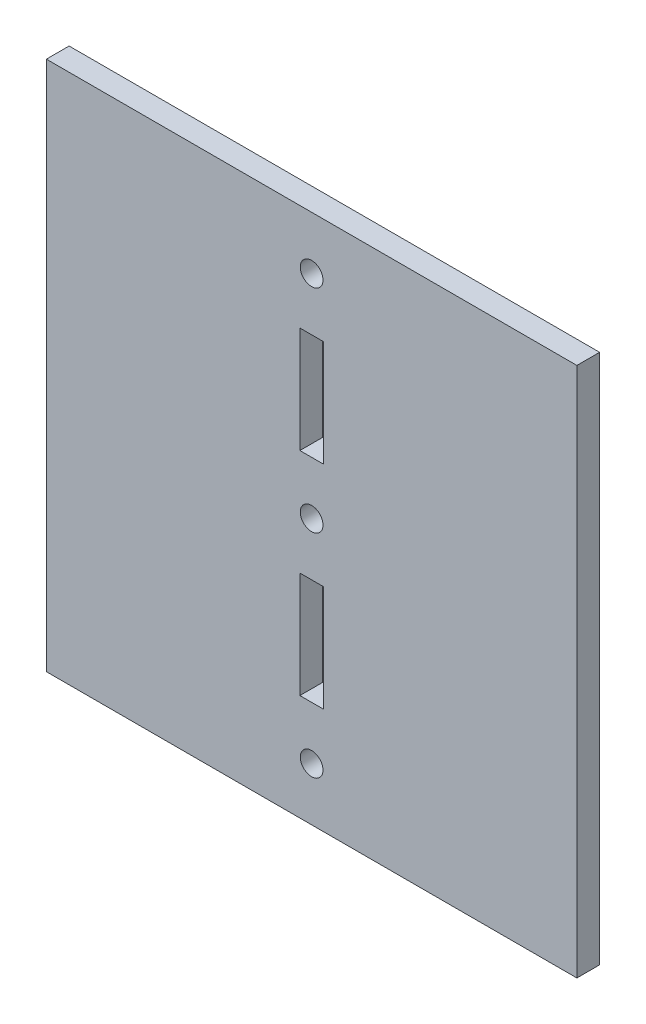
ISO-10303-21;
HEADER;
FILE_DESCRIPTION(('STEP AP214'),'2;1');
FILE_NAME('part.step','',(''),(''),'','','');
FILE_SCHEMA(('AUTOMOTIVE_DESIGN { 1 0 10303 214 1 1 1 1 }'));
ENDSEC;
DATA;
#1=APPLICATION_CONTEXT('core data for automotive mechanical design processes');
#2=APPLICATION_PROTOCOL_DEFINITION('international standard','automotive_design',2000,#1);
#3=PRODUCT_CONTEXT('',#1,'mechanical');
#4=PRODUCT('Part','Part','',(#3));
#5=PRODUCT_RELATED_PRODUCT_CATEGORY('part','',(#4));
#6=PRODUCT_DEFINITION_FORMATION('','',#4);
#7=PRODUCT_DEFINITION_CONTEXT('part definition',#1,'design');
#8=PRODUCT_DEFINITION('design','',#6,#7);
#9=PRODUCT_DEFINITION_SHAPE('','',#8);
#10=(LENGTH_UNIT() NAMED_UNIT(*) SI_UNIT(.MILLI.,.METRE.));
#11=(NAMED_UNIT(*) PLANE_ANGLE_UNIT() SI_UNIT($,.RADIAN.));
#12=(NAMED_UNIT(*) SI_UNIT($,.STERADIAN.) SOLID_ANGLE_UNIT());
#13=UNCERTAINTY_MEASURE_WITH_UNIT(LENGTH_MEASURE(1.E-05),#10,'distance_accuracy_value','');
#14=(GEOMETRIC_REPRESENTATION_CONTEXT(3) GLOBAL_UNCERTAINTY_ASSIGNED_CONTEXT((#13)) GLOBAL_UNIT_ASSIGNED_CONTEXT((#10,
#11,#12)) REPRESENTATION_CONTEXT('',''));
#15=CARTESIAN_POINT('',(0.,0.,0.));
#16=DIRECTION('',(0.,0.,1.));
#17=DIRECTION('',(1.,0.,0.));
#18=AXIS2_PLACEMENT_3D('',#15,#16,#17);
#19=CARTESIAN_POINT('',(0.,0.,3.));
#20=DIRECTION('',(0.,0.,-1.));
#21=DIRECTION('',(-1.,0.,0.));
#22=AXIS2_PLACEMENT_3D('',#19,#20,#21);
#23=PLANE('',#22);
#24=DIRECTION('',(0.,1.,0.));
#25=VECTOR('',#24,1.);
#26=CARTESIAN_POINT('',(1.55,7.,3.));
#27=LINE('',#26,#25);
#28=CARTESIAN_POINT('',(1.55,7.,3.));
#29=VERTEX_POINT('',#28);
#30=CARTESIAN_POINT('',(1.55,21.,3.));
#31=VERTEX_POINT('',#30);
#32=EDGE_CURVE('E162',#29,#31,#27,.T.);
#33=ORIENTED_EDGE('',*,*,#32,.F.);
#34=DIRECTION('',(1.,0.,0.));
#35=VECTOR('',#34,1.);
#36=CARTESIAN_POINT('',(-1.55,7.,3.));
#37=LINE('',#36,#35);
#38=CARTESIAN_POINT('',(-1.55,7.,3.));
#39=VERTEX_POINT('',#38);
#40=EDGE_CURVE('E170',#39,#29,#37,.T.);
#41=ORIENTED_EDGE('',*,*,#40,.F.);
#42=DIRECTION('',(0.,-1.,0.));
#43=VECTOR('',#42,1.);
#44=CARTESIAN_POINT('',(-1.55,7.,3.));
#45=LINE('',#44,#43);
#46=CARTESIAN_POINT('',(-1.55,21.,3.));
#47=VERTEX_POINT('',#46);
#48=EDGE_CURVE('E167',#47,#39,#45,.T.);
#49=ORIENTED_EDGE('',*,*,#48,.F.);
#50=DIRECTION('',(-1.,0.,0.));
#51=VECTOR('',#50,1.);
#52=CARTESIAN_POINT('',(-1.55,21.,3.));
#53=LINE('',#52,#51);
#54=EDGE_CURVE('E164',#31,#47,#53,.T.);
#55=ORIENTED_EDGE('',*,*,#54,.F.);
#56=EDGE_LOOP('',(#33,#41,#49,#55));
#57=FACE_BOUND('',#56,.T.);
#58=DIRECTION('',(0.,1.,0.));
#59=VECTOR('',#58,1.);
#60=CARTESIAN_POINT('',(35.,-35.,3.));
#61=LINE('',#60,#59);
#62=CARTESIAN_POINT('',(35.,-35.,3.));
#63=VERTEX_POINT('',#62);
#64=CARTESIAN_POINT('',(35.,35.,3.));
#65=VERTEX_POINT('',#64);
#66=EDGE_CURVE('E193',#63,#65,#61,.T.);
#67=ORIENTED_EDGE('',*,*,#66,.T.);
#68=DIRECTION('',(-1.,0.,0.));
#69=VECTOR('',#68,1.);
#70=CARTESIAN_POINT('',(-35.,35.,3.));
#71=LINE('',#70,#69);
#72=CARTESIAN_POINT('',(-35.,35.,3.));
#73=VERTEX_POINT('',#72);
#74=EDGE_CURVE('E196',#65,#73,#71,.T.);
#75=ORIENTED_EDGE('',*,*,#74,.T.);
#76=DIRECTION('',(0.,-1.,0.));
#77=VECTOR('',#76,1.);
#78=CARTESIAN_POINT('',(-35.,-35.,3.));
#79=LINE('',#78,#77);
#80=CARTESIAN_POINT('',(-35.,-35.,3.));
#81=VERTEX_POINT('',#80);
#82=EDGE_CURVE('E199',#73,#81,#79,.T.);
#83=ORIENTED_EDGE('',*,*,#82,.T.);
#84=DIRECTION('',(1.,0.,0.));
#85=VECTOR('',#84,1.);
#86=CARTESIAN_POINT('',(-35.,-35.,3.));
#87=LINE('',#86,#85);
#88=EDGE_CURVE('E201',#81,#63,#87,.T.);
#89=ORIENTED_EDGE('',*,*,#88,.T.);
#90=EDGE_LOOP('',(#67,#75,#83,#89));
#91=FACE_BOUND('',#90,.T.);
#92=DIRECTION('',(0.,1.,0.));
#93=VECTOR('',#92,1.);
#94=CARTESIAN_POINT('',(1.55,-21.,3.));
#95=LINE('',#94,#93);
#96=CARTESIAN_POINT('',(1.55,-21.,3.));
#97=VERTEX_POINT('',#96);
#98=CARTESIAN_POINT('',(1.55,-7.,3.));
#99=VERTEX_POINT('',#98);
#100=EDGE_CURVE('E123',#97,#99,#95,.T.);
#101=ORIENTED_EDGE('',*,*,#100,.F.);
#102=DIRECTION('',(1.,0.,0.));
#103=VECTOR('',#102,1.);
#104=CARTESIAN_POINT('',(-1.55,-21.,3.));
#105=LINE('',#104,#103);
#106=CARTESIAN_POINT('',(-1.55,-21.,3.));
#107=VERTEX_POINT('',#106);
#108=EDGE_CURVE('E146',#107,#97,#105,.T.);
#109=ORIENTED_EDGE('',*,*,#108,.F.);
#110=DIRECTION('',(0.,-1.,0.));
#111=VECTOR('',#110,1.);
#112=CARTESIAN_POINT('',(-1.55,-21.,3.));
#113=LINE('',#112,#111);
#114=CARTESIAN_POINT('',(-1.55,-7.,3.));
#115=VERTEX_POINT('',#114);
#116=EDGE_CURVE('E144',#115,#107,#113,.T.);
#117=ORIENTED_EDGE('',*,*,#116,.F.);
#118=DIRECTION('',(-1.,0.,0.));
#119=VECTOR('',#118,1.);
#120=CARTESIAN_POINT('',(-1.55,-7.,3.));
#121=LINE('',#120,#119);
#122=EDGE_CURVE('E131',#99,#115,#121,.T.);
#123=ORIENTED_EDGE('',*,*,#122,.F.);
#124=EDGE_LOOP('',(#101,#109,#117,#123));
#125=FACE_BOUND('',#124,.T.);
#126=CARTESIAN_POINT('',(0.,0.,3.));
#127=DIRECTION('',(0.,0.,1.));
#128=DIRECTION('',(1.,0.,0.));
#129=AXIS2_PLACEMENT_3D('',#126,#127,#128);
#130=CIRCLE('',#129,1.5);
#131=CARTESIAN_POINT('',(1.5,0.,3.));
#132=VERTEX_POINT('',#131);
#133=EDGE_CURVE('E152',#132,#132,#130,.T.);
#134=ORIENTED_EDGE('',*,*,#133,.F.);
#135=EDGE_LOOP('',(#134));
#136=FACE_BOUND('',#135,.T.);
#137=CARTESIAN_POINT('',(0.,28.,3.));
#138=DIRECTION('',(0.,0.,1.));
#139=DIRECTION('',(1.,0.,0.));
#140=AXIS2_PLACEMENT_3D('',#137,#138,#139);
#141=CIRCLE('',#140,1.5);
#142=CARTESIAN_POINT('',(1.5,28.,3.));
#143=VERTEX_POINT('',#142);
#144=EDGE_CURVE('E322',#143,#143,#141,.T.);
#145=ORIENTED_EDGE('',*,*,#144,.F.);
#146=EDGE_LOOP('',(#145));
#147=FACE_BOUND('',#146,.T.);
#148=CARTESIAN_POINT('',(0.,-28.,3.));
#149=DIRECTION('',(0.,0.,1.));
#150=DIRECTION('',(1.,0.,0.));
#151=AXIS2_PLACEMENT_3D('',#148,#149,#150);
#152=CIRCLE('',#151,1.5);
#153=CARTESIAN_POINT('',(1.5,-28.,3.));
#154=VERTEX_POINT('',#153);
#155=EDGE_CURVE('E313',#154,#154,#152,.T.);
#156=ORIENTED_EDGE('',*,*,#155,.F.);
#157=EDGE_LOOP('',(#156));
#158=FACE_BOUND('',#157,.T.);
#159=ADVANCED_FACE('F34',(#57,#91,#125,#136,#147,#158),#23,.F.);
#160=CARTESIAN_POINT('',(0.,0.,0.));
#161=DIRECTION('',(0.,0.,-1.));
#162=DIRECTION('',(-1.,0.,0.));
#163=AXIS2_PLACEMENT_3D('',#160,#161,#162);
#164=PLANE('',#163);
#165=CARTESIAN_POINT('',(0.,28.,0.));
#166=DIRECTION('',(0.,0.,1.));
#167=DIRECTION('',(1.,0.,0.));
#168=AXIS2_PLACEMENT_3D('',#165,#166,#167);
#169=CIRCLE('',#168,1.5);
#170=CARTESIAN_POINT('',(1.5,28.,0.));
#171=VERTEX_POINT('',#170);
#172=EDGE_CURVE('E319',#171,#171,#169,.T.);
#173=ORIENTED_EDGE('',*,*,#172,.T.);
#174=EDGE_LOOP('',(#173));
#175=FACE_BOUND('',#174,.T.);
#176=DIRECTION('',(1.,0.,0.));
#177=VECTOR('',#176,1.);
#178=CARTESIAN_POINT('',(-1.55,-21.,0.));
#179=LINE('',#178,#177);
#180=CARTESIAN_POINT('',(-1.55,-21.,0.));
#181=VERTEX_POINT('',#180);
#182=CARTESIAN_POINT('',(1.55,-21.,0.));
#183=VERTEX_POINT('',#182);
#184=EDGE_CURVE('E132',#181,#183,#179,.T.);
#185=ORIENTED_EDGE('',*,*,#184,.T.);
#186=DIRECTION('',(0.,1.,0.));
#187=VECTOR('',#186,1.);
#188=CARTESIAN_POINT('',(1.55,-21.,0.));
#189=LINE('',#188,#187);
#190=CARTESIAN_POINT('',(1.55,-7.,0.));
#191=VERTEX_POINT('',#190);
#192=EDGE_CURVE('E57',#183,#191,#189,.T.);
#193=ORIENTED_EDGE('',*,*,#192,.T.);
#194=DIRECTION('',(-1.,0.,0.));
#195=VECTOR('',#194,1.);
#196=CARTESIAN_POINT('',(-1.55,-7.,0.));
#197=LINE('',#196,#195);
#198=CARTESIAN_POINT('',(-1.55,-7.,0.));
#199=VERTEX_POINT('',#198);
#200=EDGE_CURVE('E138',#191,#199,#197,.T.);
#201=ORIENTED_EDGE('',*,*,#200,.T.);
#202=DIRECTION('',(0.,-1.,0.));
#203=VECTOR('',#202,1.);
#204=CARTESIAN_POINT('',(-1.55,-21.,0.));
#205=LINE('',#204,#203);
#206=EDGE_CURVE('E154',#199,#181,#205,.T.);
#207=ORIENTED_EDGE('',*,*,#206,.T.);
#208=EDGE_LOOP('',(#185,#193,#201,#207));
#209=FACE_BOUND('',#208,.T.);
#210=DIRECTION('',(1.,0.,0.));
#211=VECTOR('',#210,1.);
#212=CARTESIAN_POINT('',(-1.55,7.,0.));
#213=LINE('',#212,#211);
#214=CARTESIAN_POINT('',(-1.55,7.,0.));
#215=VERTEX_POINT('',#214);
#216=CARTESIAN_POINT('',(1.55,7.,0.));
#217=VERTEX_POINT('',#216);
#218=EDGE_CURVE('E165',#215,#217,#213,.T.);
#219=ORIENTED_EDGE('',*,*,#218,.T.);
#220=DIRECTION('',(0.,1.,0.));
#221=VECTOR('',#220,1.);
#222=CARTESIAN_POINT('',(1.55,7.,0.));
#223=LINE('',#222,#221);
#224=CARTESIAN_POINT('',(1.55,21.,0.));
#225=VERTEX_POINT('',#224);
#226=EDGE_CURVE('E139',#217,#225,#223,.T.);
#227=ORIENTED_EDGE('',*,*,#226,.T.);
#228=DIRECTION('',(-1.,0.,0.));
#229=VECTOR('',#228,1.);
#230=CARTESIAN_POINT('',(-1.55,21.,0.));
#231=LINE('',#230,#229);
#232=CARTESIAN_POINT('',(-1.55,21.,0.));
#233=VERTEX_POINT('',#232);
#234=EDGE_CURVE('E175',#225,#233,#231,.T.);
#235=ORIENTED_EDGE('',*,*,#234,.T.);
#236=DIRECTION('',(0.,-1.,0.));
#237=VECTOR('',#236,1.);
#238=CARTESIAN_POINT('',(-1.55,7.,0.));
#239=LINE('',#238,#237);
#240=EDGE_CURVE('E178',#233,#215,#239,.T.);
#241=ORIENTED_EDGE('',*,*,#240,.T.);
#242=EDGE_LOOP('',(#219,#227,#235,#241));
#243=FACE_BOUND('',#242,.T.);
#244=DIRECTION('',(0.,1.,0.));
#245=VECTOR('',#244,1.);
#246=CARTESIAN_POINT('',(35.,-35.,0.));
#247=LINE('',#246,#245);
#248=CARTESIAN_POINT('',(35.,-35.,0.));
#249=VERTEX_POINT('',#248);
#250=CARTESIAN_POINT('',(35.,35.,0.));
#251=VERTEX_POINT('',#250);
#252=EDGE_CURVE('E192',#249,#251,#247,.T.);
#253=ORIENTED_EDGE('',*,*,#252,.F.);
#254=DIRECTION('',(1.,0.,0.));
#255=VECTOR('',#254,1.);
#256=CARTESIAN_POINT('',(-35.,-35.,0.));
#257=LINE('',#256,#255);
#258=CARTESIAN_POINT('',(-35.,-35.,0.));
#259=VERTEX_POINT('',#258);
#260=EDGE_CURVE('E197',#259,#249,#257,.T.);
#261=ORIENTED_EDGE('',*,*,#260,.F.);
#262=DIRECTION('',(0.,-1.,0.));
#263=VECTOR('',#262,1.);
#264=CARTESIAN_POINT('',(-35.,-35.,0.));
#265=LINE('',#264,#263);
#266=CARTESIAN_POINT('',(-35.,35.,0.));
#267=VERTEX_POINT('',#266);
#268=EDGE_CURVE('E208',#267,#259,#265,.T.);
#269=ORIENTED_EDGE('',*,*,#268,.F.);
#270=DIRECTION('',(-1.,0.,0.));
#271=VECTOR('',#270,1.);
#272=CARTESIAN_POINT('',(-35.,35.,0.));
#273=LINE('',#272,#271);
#274=EDGE_CURVE('E206',#251,#267,#273,.T.);
#275=ORIENTED_EDGE('',*,*,#274,.F.);
#276=EDGE_LOOP('',(#253,#261,#269,#275));
#277=FACE_BOUND('',#276,.T.);
#278=CARTESIAN_POINT('',(0.,0.,0.));
#279=DIRECTION('',(0.,0.,1.));
#280=DIRECTION('',(1.,0.,0.));
#281=AXIS2_PLACEMENT_3D('',#278,#279,#280);
#282=CIRCLE('',#281,1.5);
#283=CARTESIAN_POINT('',(1.5,0.,0.));
#284=VERTEX_POINT('',#283);
#285=EDGE_CURVE('E325',#284,#284,#282,.T.);
#286=ORIENTED_EDGE('',*,*,#285,.T.);
#287=EDGE_LOOP('',(#286));
#288=FACE_BOUND('',#287,.T.);
#289=CARTESIAN_POINT('',(0.,-28.,0.));
#290=DIRECTION('',(0.,0.,1.));
#291=DIRECTION('',(1.,0.,0.));
#292=AXIS2_PLACEMENT_3D('',#289,#290,#291);
#293=CIRCLE('',#292,1.5);
#294=CARTESIAN_POINT('',(1.5,-28.,0.));
#295=VERTEX_POINT('',#294);
#296=EDGE_CURVE('E316',#295,#295,#293,.T.);
#297=ORIENTED_EDGE('',*,*,#296,.T.);
#298=EDGE_LOOP('',(#297));
#299=FACE_BOUND('',#298,.T.);
#300=ADVANCED_FACE('F226',(#175,#209,#243,#277,#288,#299),#164,.T.);
#301=CARTESIAN_POINT('',(35.,-35.,3.));
#302=DIRECTION('',(-1.,0.,0.));
#303=DIRECTION('',(0.,0.,1.));
#304=AXIS2_PLACEMENT_3D('',#301,#302,#303);
#305=PLANE('',#304);
#306=ORIENTED_EDGE('',*,*,#252,.T.);
#307=DIRECTION('',(0.,0.,-1.));
#308=VECTOR('',#307,1.);
#309=CARTESIAN_POINT('',(35.,35.,3.));
#310=LINE('',#309,#308);
#311=EDGE_CURVE('E11',#65,#251,#310,.T.);
#312=ORIENTED_EDGE('',*,*,#311,.F.);
#313=ORIENTED_EDGE('',*,*,#66,.F.);
#314=DIRECTION('',(0.,0.,-1.));
#315=VECTOR('',#314,1.);
#316=CARTESIAN_POINT('',(35.,-35.,3.));
#317=LINE('',#316,#315);
#318=EDGE_CURVE('E203',#63,#249,#317,.T.);
#319=ORIENTED_EDGE('',*,*,#318,.T.);
#320=EDGE_LOOP('',(#306,#312,#313,#319));
#321=FACE_BOUND('',#320,.T.);
#322=ADVANCED_FACE('F36',(#321),#305,.F.);
#323=CARTESIAN_POINT('',(-35.,35.,3.));
#324=DIRECTION('',(0.,-1.,0.));
#325=DIRECTION('',(0.,0.,-1.));
#326=AXIS2_PLACEMENT_3D('',#323,#324,#325);
#327=PLANE('',#326);
#328=ORIENTED_EDGE('',*,*,#274,.T.);
#329=DIRECTION('',(0.,0.,-1.));
#330=VECTOR('',#329,1.);
#331=CARTESIAN_POINT('',(-35.,35.,3.));
#332=LINE('',#331,#330);
#333=EDGE_CURVE('E42',#73,#267,#332,.T.);
#334=ORIENTED_EDGE('',*,*,#333,.F.);
#335=ORIENTED_EDGE('',*,*,#74,.F.);
#336=ORIENTED_EDGE('',*,*,#311,.T.);
#337=EDGE_LOOP('',(#328,#334,#335,#336));
#338=FACE_BOUND('',#337,.T.);
#339=ADVANCED_FACE('F236',(#338),#327,.F.);
#340=CARTESIAN_POINT('',(-35.,-35.,3.));
#341=DIRECTION('',(1.,0.,0.));
#342=DIRECTION('',(0.,0.,-1.));
#343=AXIS2_PLACEMENT_3D('',#340,#341,#342);
#344=PLANE('',#343);
#345=ORIENTED_EDGE('',*,*,#268,.T.);
#346=DIRECTION('',(0.,0.,-1.));
#347=VECTOR('',#346,1.);
#348=CARTESIAN_POINT('',(-35.,-35.,3.));
#349=LINE('',#348,#347);
#350=EDGE_CURVE('E213',#81,#259,#349,.T.);
#351=ORIENTED_EDGE('',*,*,#350,.F.);
#352=ORIENTED_EDGE('',*,*,#82,.F.);
#353=ORIENTED_EDGE('',*,*,#333,.T.);
#354=EDGE_LOOP('',(#345,#351,#352,#353));
#355=FACE_BOUND('',#354,.T.);
#356=ADVANCED_FACE('F220',(#355),#344,.F.);
#357=CARTESIAN_POINT('',(-35.,-35.,3.));
#358=DIRECTION('',(0.,1.,0.));
#359=DIRECTION('',(0.,0.,1.));
#360=AXIS2_PLACEMENT_3D('',#357,#358,#359);
#361=PLANE('',#360);
#362=ORIENTED_EDGE('',*,*,#260,.T.);
#363=ORIENTED_EDGE('',*,*,#318,.F.);
#364=ORIENTED_EDGE('',*,*,#88,.F.);
#365=ORIENTED_EDGE('',*,*,#350,.T.);
#366=EDGE_LOOP('',(#362,#363,#364,#365));
#367=FACE_BOUND('',#366,.T.);
#368=ADVANCED_FACE('F230',(#367),#361,.F.);
#369=CARTESIAN_POINT('',(1.55,7.,3.));
#370=DIRECTION('',(-1.,0.,0.));
#371=DIRECTION('',(0.,-1.,0.));
#372=AXIS2_PLACEMENT_3D('',#369,#370,#371);
#373=PLANE('',#372);
#374=ORIENTED_EDGE('',*,*,#226,.F.);
#375=DIRECTION('',(0.,0.,-1.));
#376=VECTOR('',#375,1.);
#377=CARTESIAN_POINT('',(1.55,7.,3.));
#378=LINE('',#377,#376);
#379=EDGE_CURVE('E172',#29,#217,#378,.T.);
#380=ORIENTED_EDGE('',*,*,#379,.F.);
#381=ORIENTED_EDGE('',*,*,#32,.T.);
#382=DIRECTION('',(0.,0.,-1.));
#383=VECTOR('',#382,1.);
#384=CARTESIAN_POINT('',(1.55,21.,3.));
#385=LINE('',#384,#383);
#386=EDGE_CURVE('E189',#31,#225,#385,.T.);
#387=ORIENTED_EDGE('',*,*,#386,.T.);
#388=EDGE_LOOP('',(#374,#380,#381,#387));
#389=FACE_BOUND('',#388,.T.);
#390=ADVANCED_FACE('F253',(#389),#373,.T.);
#391=CARTESIAN_POINT('',(-1.55,21.,3.));
#392=DIRECTION('',(0.,-1.,0.));
#393=DIRECTION('',(0.,0.,-1.));
#394=AXIS2_PLACEMENT_3D('',#391,#392,#393);
#395=PLANE('',#394);
#396=ORIENTED_EDGE('',*,*,#234,.F.);
#397=ORIENTED_EDGE('',*,*,#386,.F.);
#398=ORIENTED_EDGE('',*,*,#54,.T.);
#399=DIRECTION('',(0.,0.,-1.));
#400=VECTOR('',#399,1.);
#401=CARTESIAN_POINT('',(-1.55,21.,3.));
#402=LINE('',#401,#400);
#403=EDGE_CURVE('E187',#47,#233,#402,.T.);
#404=ORIENTED_EDGE('',*,*,#403,.T.);
#405=EDGE_LOOP('',(#396,#397,#398,#404));
#406=FACE_BOUND('',#405,.T.);
#407=ADVANCED_FACE('F260',(#406),#395,.T.);
#408=CARTESIAN_POINT('',(-1.55,7.,3.));
#409=DIRECTION('',(1.,0.,0.));
#410=DIRECTION('',(0.,1.,0.));
#411=AXIS2_PLACEMENT_3D('',#408,#409,#410);
#412=PLANE('',#411);
#413=ORIENTED_EDGE('',*,*,#240,.F.);
#414=ORIENTED_EDGE('',*,*,#403,.F.);
#415=ORIENTED_EDGE('',*,*,#48,.T.);
#416=DIRECTION('',(0.,0.,-1.));
#417=VECTOR('',#416,1.);
#418=CARTESIAN_POINT('',(-1.55,7.,3.));
#419=LINE('',#418,#417);
#420=EDGE_CURVE('E185',#39,#215,#419,.T.);
#421=ORIENTED_EDGE('',*,*,#420,.T.);
#422=EDGE_LOOP('',(#413,#414,#415,#421));
#423=FACE_BOUND('',#422,.T.);
#424=ADVANCED_FACE('F265',(#423),#412,.T.);
#425=CARTESIAN_POINT('',(-1.55,7.,3.));
#426=DIRECTION('',(0.,1.,0.));
#427=DIRECTION('',(-1.,0.,0.));
#428=AXIS2_PLACEMENT_3D('',#425,#426,#427);
#429=PLANE('',#428);
#430=ORIENTED_EDGE('',*,*,#218,.F.);
#431=ORIENTED_EDGE('',*,*,#420,.F.);
#432=ORIENTED_EDGE('',*,*,#40,.T.);
#433=ORIENTED_EDGE('',*,*,#379,.T.);
#434=EDGE_LOOP('',(#430,#431,#432,#433));
#435=FACE_BOUND('',#434,.T.);
#436=ADVANCED_FACE('F272',(#435),#429,.T.);
#437=CARTESIAN_POINT('',(1.55,-21.,3.));
#438=DIRECTION('',(-1.,0.,0.));
#439=DIRECTION('',(0.,0.,1.));
#440=AXIS2_PLACEMENT_3D('',#437,#438,#439);
#441=PLANE('',#440);
#442=ORIENTED_EDGE('',*,*,#192,.F.);
#443=DIRECTION('',(0.,0.,-1.));
#444=VECTOR('',#443,1.);
#445=CARTESIAN_POINT('',(1.55,-21.,3.));
#446=LINE('',#445,#444);
#447=EDGE_CURVE('E127',#97,#183,#446,.T.);
#448=ORIENTED_EDGE('',*,*,#447,.F.);
#449=ORIENTED_EDGE('',*,*,#100,.T.);
#450=DIRECTION('',(0.,0.,-1.));
#451=VECTOR('',#450,1.);
#452=CARTESIAN_POINT('',(1.55,-7.,3.));
#453=LINE('',#452,#451);
#454=EDGE_CURVE('E126',#99,#191,#453,.T.);
#455=ORIENTED_EDGE('',*,*,#454,.T.);
#456=EDGE_LOOP('',(#442,#448,#449,#455));
#457=FACE_BOUND('',#456,.T.);
#458=ADVANCED_FACE('F125',(#457),#441,.T.);
#459=CARTESIAN_POINT('',(-1.55,-7.,3.));
#460=DIRECTION('',(0.,-1.,0.));
#461=DIRECTION('',(0.,0.,-1.));
#462=AXIS2_PLACEMENT_3D('',#459,#460,#461);
#463=PLANE('',#462);
#464=ORIENTED_EDGE('',*,*,#200,.F.);
#465=ORIENTED_EDGE('',*,*,#454,.F.);
#466=ORIENTED_EDGE('',*,*,#122,.T.);
#467=DIRECTION('',(0.,0.,-1.));
#468=VECTOR('',#467,1.);
#469=CARTESIAN_POINT('',(-1.55,-7.,3.));
#470=LINE('',#469,#468);
#471=EDGE_CURVE('E140',#115,#199,#470,.T.);
#472=ORIENTED_EDGE('',*,*,#471,.T.);
#473=EDGE_LOOP('',(#464,#465,#466,#472));
#474=FACE_BOUND('',#473,.T.);
#475=ADVANCED_FACE('F135',(#474),#463,.T.);
#476=CARTESIAN_POINT('',(-1.55,-21.,3.));
#477=DIRECTION('',(1.,0.,0.));
#478=DIRECTION('',(0.,0.,-1.));
#479=AXIS2_PLACEMENT_3D('',#476,#477,#478);
#480=PLANE('',#479);
#481=ORIENTED_EDGE('',*,*,#206,.F.);
#482=ORIENTED_EDGE('',*,*,#471,.F.);
#483=ORIENTED_EDGE('',*,*,#116,.T.);
#484=DIRECTION('',(0.,0.,-1.));
#485=VECTOR('',#484,1.);
#486=CARTESIAN_POINT('',(-1.55,-21.,3.));
#487=LINE('',#486,#485);
#488=EDGE_CURVE('E49',#107,#181,#487,.T.);
#489=ORIENTED_EDGE('',*,*,#488,.T.);
#490=EDGE_LOOP('',(#481,#482,#483,#489));
#491=FACE_BOUND('',#490,.T.);
#492=ADVANCED_FACE('F290',(#491),#480,.T.);
#493=CARTESIAN_POINT('',(-1.55,-21.,3.));
#494=DIRECTION('',(0.,1.,0.));
#495=DIRECTION('',(0.,0.,1.));
#496=AXIS2_PLACEMENT_3D('',#493,#494,#495);
#497=PLANE('',#496);
#498=ORIENTED_EDGE('',*,*,#184,.F.);
#499=ORIENTED_EDGE('',*,*,#488,.F.);
#500=ORIENTED_EDGE('',*,*,#108,.T.);
#501=ORIENTED_EDGE('',*,*,#447,.T.);
#502=EDGE_LOOP('',(#498,#499,#500,#501));
#503=FACE_BOUND('',#502,.T.);
#504=ADVANCED_FACE('F293',(#503),#497,.T.);
#505=CARTESIAN_POINT('',(0.,0.,3.));
#506=DIRECTION('',(0.,0.,-1.));
#507=DIRECTION('',(-1.,0.,0.));
#508=AXIS2_PLACEMENT_3D('',#505,#506,#507);
#509=CYLINDRICAL_SURFACE('',#508,1.5);
#510=ORIENTED_EDGE('',*,*,#133,.T.);
#511=EDGE_LOOP('',(#510));
#512=FACE_BOUND('',#511,.T.);
#513=ORIENTED_EDGE('',*,*,#285,.F.);
#514=EDGE_LOOP('',(#513));
#515=FACE_BOUND('',#514,.T.);
#516=ADVANCED_FACE('F297',(#512,#515),#509,.F.);
#517=CARTESIAN_POINT('',(0.,28.,3.));
#518=DIRECTION('',(0.,0.,-1.));
#519=DIRECTION('',(-1.,0.,0.));
#520=AXIS2_PLACEMENT_3D('',#517,#518,#519);
#521=CYLINDRICAL_SURFACE('',#520,1.5);
#522=ORIENTED_EDGE('',*,*,#144,.T.);
#523=EDGE_LOOP('',(#522));
#524=FACE_BOUND('',#523,.T.);
#525=ORIENTED_EDGE('',*,*,#172,.F.);
#526=EDGE_LOOP('',(#525));
#527=FACE_BOUND('',#526,.T.);
#528=ADVANCED_FACE('F300',(#524,#527),#521,.F.);
#529=CARTESIAN_POINT('',(0.,-28.,3.));
#530=DIRECTION('',(0.,0.,-1.));
#531=DIRECTION('',(-1.,0.,0.));
#532=AXIS2_PLACEMENT_3D('',#529,#530,#531);
#533=CYLINDRICAL_SURFACE('',#532,1.5);
#534=ORIENTED_EDGE('',*,*,#155,.T.);
#535=EDGE_LOOP('',(#534));
#536=FACE_BOUND('',#535,.T.);
#537=ORIENTED_EDGE('',*,*,#296,.F.);
#538=EDGE_LOOP('',(#537));
#539=FACE_BOUND('',#538,.T.);
#540=ADVANCED_FACE('F304',(#536,#539),#533,.F.);
#541=CLOSED_SHELL('',(#159,#300,#322,#339,#356,#368,#390,#407,#424,#436,#458,#475,#492,#504,
#516,#528,#540));
#542=MANIFOLD_SOLID_BREP('B2',#541);
#543=ADVANCED_BREP_SHAPE_REPRESENTATION('',(#18,#542),#14);
#544=SHAPE_DEFINITION_REPRESENTATION(#9,#543);
ENDSEC;
END-ISO-10303-21;
